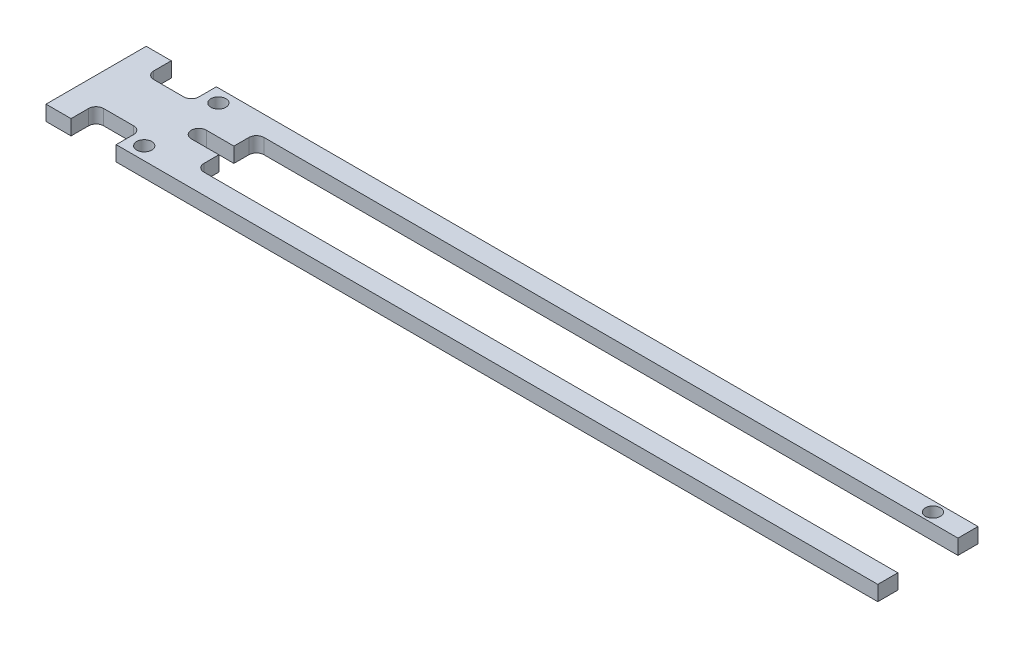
from build123d import *

# Parameters (mm, degrees)
SKETCH_1_R      = 0.75
EXTRUDE_1_DEPTH = 1.5


with BuildPart() as part:
    # Sketch 1 → Extrude 1 (new body)
    with BuildSketch(Plane(origin=(0, 0, 0), x_dir=(1, 0, 0), z_dir=(0, 1, 0))):
        with BuildLine():
            ThreePointArc((-17.292091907, 0.855263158), (-18.042091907, 0.105263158), (-17.292091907, -0.644736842))
            Line((-17.292091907, -0.644736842), (-14.542091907, -0.644736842))
            Line((-14.542091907, -0.644736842), (-14.542091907, -2.144736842))
            ThreePointArc((-14.542091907, -2.144736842), (-14.322421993, -2.675066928), (-13.792091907, -2.894736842))
            Line((-13.792091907, -2.894736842), (55.457908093, -2.894736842))
            Line((55.457908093, -2.894736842), (55.457908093, -4.894736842))
            Line((55.457908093, -4.894736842), (-20.542091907, -4.894736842))
            Line((-20.542091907, -4.894736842), (-20.542091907, -3.144736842))
            ThreePointArc((-20.542091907, -3.144736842), (-20.761761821, -2.614406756), (-21.292091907, -2.394736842))
            Line((-21.292091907, -2.394736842), (-24.292091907, -2.394736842))
            ThreePointArc((-24.292091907, -2.394736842), (-24.822421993, -2.614406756), (-25.042091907, -3.144736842))
            Line((-25.042091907, -3.144736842), (-25.042091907, -4.894736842))
            Line((-25.042091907, -4.894736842), (-27.542091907, -4.894736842))
            Line((-27.542091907, -4.894736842), (-27.542091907, 5.105263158))
            Line((-27.542091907, 5.105263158), (-25.042091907, 5.105263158))
            Line((-25.042091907, 5.105263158), (-25.042091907, 3.355263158))
            ThreePointArc((-25.042091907, 3.355263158), (-24.822421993, 2.824933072), (-24.292091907, 2.605263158))
            Line((-24.292091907, 2.605263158), (-21.292091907, 2.605263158))
            ThreePointArc((-21.292091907, 2.605263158), (-20.761761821, 2.824933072), (-20.542091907, 3.355263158))
            Line((-20.542091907, 3.355263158), (-20.542091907, 5.105263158))
            Line((-20.542091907, 5.105263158), (55.457908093, 5.105263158))
            Line((55.457908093, 5.105263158), (55.457908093, 3.105263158))
            Line((55.457908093, 3.105263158), (-13.792091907, 3.105263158))
            ThreePointArc((-13.792091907, 3.105263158), (-14.322421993, 2.885593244), (-14.542091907, 2.355263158))
            Line((-14.542091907, 2.355263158), (-14.542091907, 0.855263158))
            Line((-14.542091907, 0.855263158), (-17.292091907, 0.855263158))
        make_face()
        with Locations(Location((51.957908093, 4.105263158, 0), (0, 0, 270))):
            Circle(SKETCH_1_R, mode=Mode.SUBTRACT)
        with Locations(Location((-19.042091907, -3.594736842, 0), (0, 0, 270))):
            Circle(SKETCH_1_R, mode=Mode.SUBTRACT)
        with Locations(Location((-19.042091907, 3.805263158, 0), (0, 0, 270))):
            Circle(SKETCH_1_R, mode=Mode.SUBTRACT)
    extrude(amount=EXTRUDE_1_DEPTH)


solid = part.part
